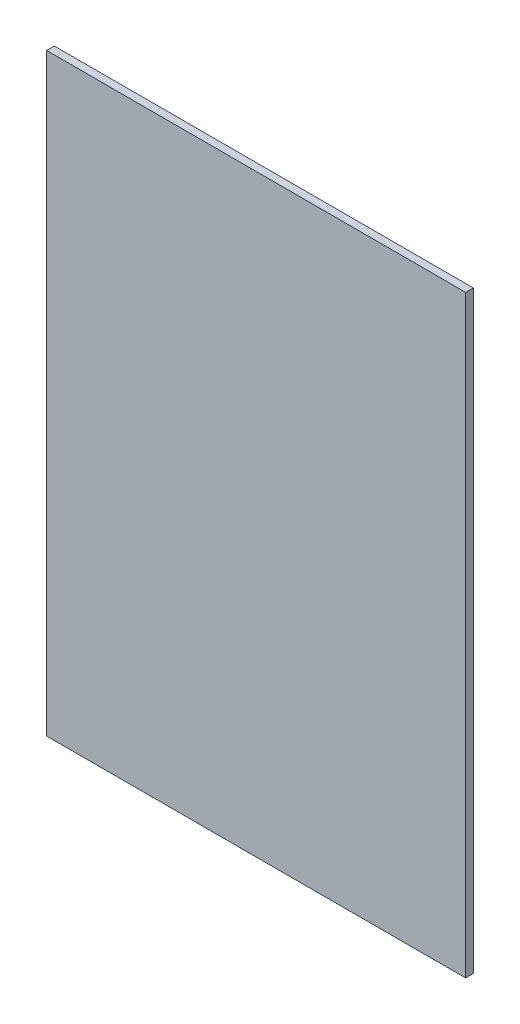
ISO-10303-21;
HEADER;
FILE_DESCRIPTION(('STEP AP214'),'2;1');
FILE_NAME('part.step','',(''),(''),'','','');
FILE_SCHEMA(('AUTOMOTIVE_DESIGN { 1 0 10303 214 1 1 1 1 }'));
ENDSEC;
DATA;
#1=APPLICATION_CONTEXT('core data for automotive mechanical design processes');
#2=APPLICATION_PROTOCOL_DEFINITION('international standard','automotive_design',2000,#1);
#3=PRODUCT_CONTEXT('',#1,'mechanical');
#4=PRODUCT('Part','Part','',(#3));
#5=PRODUCT_RELATED_PRODUCT_CATEGORY('part','',(#4));
#6=PRODUCT_DEFINITION_FORMATION('','',#4);
#7=PRODUCT_DEFINITION_CONTEXT('part definition',#1,'design');
#8=PRODUCT_DEFINITION('design','',#6,#7);
#9=PRODUCT_DEFINITION_SHAPE('','',#8);
#10=(LENGTH_UNIT() NAMED_UNIT(*) SI_UNIT(.MILLI.,.METRE.));
#11=(NAMED_UNIT(*) PLANE_ANGLE_UNIT() SI_UNIT($,.RADIAN.));
#12=(NAMED_UNIT(*) SI_UNIT($,.STERADIAN.) SOLID_ANGLE_UNIT());
#13=UNCERTAINTY_MEASURE_WITH_UNIT(LENGTH_MEASURE(1.E-05),#10,'distance_accuracy_value','');
#14=(GEOMETRIC_REPRESENTATION_CONTEXT(3) GLOBAL_UNCERTAINTY_ASSIGNED_CONTEXT((#13)) GLOBAL_UNIT_ASSIGNED_CONTEXT((#10,
#11,#12)) REPRESENTATION_CONTEXT('',''));
#15=CARTESIAN_POINT('',(0.,0.,0.));
#16=DIRECTION('',(0.,0.,1.));
#17=DIRECTION('',(1.,0.,0.));
#18=AXIS2_PLACEMENT_3D('',#15,#16,#17);
#19=CARTESIAN_POINT('',(76.2,107.95,2.794));
#20=DIRECTION('',(-1.,0.,0.));
#21=DIRECTION('',(0.,-1.,0.));
#22=AXIS2_PLACEMENT_3D('',#19,#20,#21);
#23=PLANE('',#22);
#24=DIRECTION('',(0.,1.,0.));
#25=VECTOR('',#24,1.);
#26=CARTESIAN_POINT('',(76.2,107.95,0.));
#27=LINE('',#26,#25);
#28=CARTESIAN_POINT('',(76.2,-107.95,0.));
#29=VERTEX_POINT('',#28);
#30=CARTESIAN_POINT('',(76.2,107.95,0.));
#31=VERTEX_POINT('',#30);
#32=EDGE_CURVE('E96',#29,#31,#27,.T.);
#33=ORIENTED_EDGE('',*,*,#32,.T.);
#34=DIRECTION('',(0.,0.,-1.));
#35=VECTOR('',#34,1.);
#36=CARTESIAN_POINT('',(76.2,107.95,2.794));
#37=LINE('',#36,#35);
#38=CARTESIAN_POINT('',(76.2,107.95,2.794));
#39=VERTEX_POINT('',#38);
#40=EDGE_CURVE('E11',#39,#31,#37,.T.);
#41=ORIENTED_EDGE('',*,*,#40,.F.);
#42=DIRECTION('',(0.,1.,0.));
#43=VECTOR('',#42,1.);
#44=CARTESIAN_POINT('',(76.2,107.95,2.794));
#45=LINE('',#44,#43);
#46=CARTESIAN_POINT('',(76.2,-107.95,2.794));
#47=VERTEX_POINT('',#46);
#48=EDGE_CURVE('E84',#47,#39,#45,.T.);
#49=ORIENTED_EDGE('',*,*,#48,.F.);
#50=DIRECTION('',(0.,0.,-1.));
#51=VECTOR('',#50,1.);
#52=CARTESIAN_POINT('',(76.2,-107.95,2.794));
#53=LINE('',#52,#51);
#54=EDGE_CURVE('E92',#47,#29,#53,.T.);
#55=ORIENTED_EDGE('',*,*,#54,.T.);
#56=EDGE_LOOP('',(#33,#41,#49,#55));
#57=FACE_BOUND('',#56,.T.);
#58=ADVANCED_FACE('F33',(#57),#23,.F.);
#59=CARTESIAN_POINT('',(-76.2,107.95,2.794));
#60=DIRECTION('',(0.,-1.,0.));
#61=DIRECTION('',(0.,0.,-1.));
#62=AXIS2_PLACEMENT_3D('',#59,#60,#61);
#63=PLANE('',#62);
#64=DIRECTION('',(-1.,0.,0.));
#65=VECTOR('',#64,1.);
#66=CARTESIAN_POINT('',(-76.2,107.95,0.));
#67=LINE('',#66,#65);
#68=CARTESIAN_POINT('',(-76.2,107.95,0.));
#69=VERTEX_POINT('',#68);
#70=EDGE_CURVE('E88',#31,#69,#67,.T.);
#71=ORIENTED_EDGE('',*,*,#70,.T.);
#72=DIRECTION('',(0.,0.,-1.));
#73=VECTOR('',#72,1.);
#74=CARTESIAN_POINT('',(-76.2,107.95,2.794));
#75=LINE('',#74,#73);
#76=CARTESIAN_POINT('',(-76.2,107.95,2.794));
#77=VERTEX_POINT('',#76);
#78=EDGE_CURVE('E41',#77,#69,#75,.T.);
#79=ORIENTED_EDGE('',*,*,#78,.F.);
#80=DIRECTION('',(-1.,0.,0.));
#81=VECTOR('',#80,1.);
#82=CARTESIAN_POINT('',(-76.2,107.95,2.794));
#83=LINE('',#82,#81);
#84=EDGE_CURVE('E79',#39,#77,#83,.T.);
#85=ORIENTED_EDGE('',*,*,#84,.F.);
#86=ORIENTED_EDGE('',*,*,#40,.T.);
#87=EDGE_LOOP('',(#71,#79,#85,#86));
#88=FACE_BOUND('',#87,.T.);
#89=ADVANCED_FACE('F87',(#88),#63,.F.);
#90=CARTESIAN_POINT('',(-76.2,107.95,2.794));
#91=DIRECTION('',(1.,0.,0.));
#92=DIRECTION('',(0.,1.,0.));
#93=AXIS2_PLACEMENT_3D('',#90,#91,#92);
#94=PLANE('',#93);
#95=DIRECTION('',(0.,-1.,0.));
#96=VECTOR('',#95,1.);
#97=CARTESIAN_POINT('',(-76.2,107.95,0.));
#98=LINE('',#97,#96);
#99=CARTESIAN_POINT('',(-76.2,-107.95,0.));
#100=VERTEX_POINT('',#99);
#101=EDGE_CURVE('E66',#69,#100,#98,.T.);
#102=ORIENTED_EDGE('',*,*,#101,.T.);
#103=DIRECTION('',(0.,0.,-1.));
#104=VECTOR('',#103,1.);
#105=CARTESIAN_POINT('',(-76.2,-107.95,2.794));
#106=LINE('',#105,#104);
#107=CARTESIAN_POINT('',(-76.2,-107.95,2.794));
#108=VERTEX_POINT('',#107);
#109=EDGE_CURVE('E89',#108,#100,#106,.T.);
#110=ORIENTED_EDGE('',*,*,#109,.F.);
#111=DIRECTION('',(0.,-1.,0.));
#112=VECTOR('',#111,1.);
#113=CARTESIAN_POINT('',(-76.2,107.95,2.794));
#114=LINE('',#113,#112);
#115=EDGE_CURVE('E82',#77,#108,#114,.T.);
#116=ORIENTED_EDGE('',*,*,#115,.F.);
#117=ORIENTED_EDGE('',*,*,#78,.T.);
#118=EDGE_LOOP('',(#102,#110,#116,#117));
#119=FACE_BOUND('',#118,.T.);
#120=ADVANCED_FACE('F90',(#119),#94,.F.);
#121=CARTESIAN_POINT('',(-76.2,-107.95,2.794));
#122=DIRECTION('',(0.,1.,0.));
#123=DIRECTION('',(0.,0.,1.));
#124=AXIS2_PLACEMENT_3D('',#121,#122,#123);
#125=PLANE('',#124);
#126=DIRECTION('',(1.,0.,0.));
#127=VECTOR('',#126,1.);
#128=CARTESIAN_POINT('',(-76.2,-107.95,0.));
#129=LINE('',#128,#127);
#130=EDGE_CURVE('E72',#100,#29,#129,.T.);
#131=ORIENTED_EDGE('',*,*,#130,.T.);
#132=ORIENTED_EDGE('',*,*,#54,.F.);
#133=DIRECTION('',(1.,0.,0.));
#134=VECTOR('',#133,1.);
#135=CARTESIAN_POINT('',(-76.2,-107.95,2.794));
#136=LINE('',#135,#134);
#137=EDGE_CURVE('E49',#108,#47,#136,.T.);
#138=ORIENTED_EDGE('',*,*,#137,.F.);
#139=ORIENTED_EDGE('',*,*,#109,.T.);
#140=EDGE_LOOP('',(#131,#132,#138,#139));
#141=FACE_BOUND('',#140,.T.);
#142=ADVANCED_FACE('F103',(#141),#125,.F.);
#143=CARTESIAN_POINT('',(0.,0.,2.794));
#144=DIRECTION('',(0.,0.,1.));
#145=DIRECTION('',(1.,0.,0.));
#146=AXIS2_PLACEMENT_3D('',#143,#144,#145);
#147=PLANE('',#146);
#148=ORIENTED_EDGE('',*,*,#48,.T.);
#149=ORIENTED_EDGE('',*,*,#84,.T.);
#150=ORIENTED_EDGE('',*,*,#115,.T.);
#151=ORIENTED_EDGE('',*,*,#137,.T.);
#152=EDGE_LOOP('',(#148,#149,#150,#151));
#153=FACE_BOUND('',#152,.T.);
#154=ADVANCED_FACE('F80',(#153),#147,.T.);
#155=CARTESIAN_POINT('',(0.,0.,0.));
#156=DIRECTION('',(0.,0.,1.));
#157=DIRECTION('',(1.,0.,0.));
#158=AXIS2_PLACEMENT_3D('',#155,#156,#157);
#159=PLANE('',#158);
#160=ORIENTED_EDGE('',*,*,#32,.F.);
#161=ORIENTED_EDGE('',*,*,#130,.F.);
#162=ORIENTED_EDGE('',*,*,#101,.F.);
#163=ORIENTED_EDGE('',*,*,#70,.F.);
#164=EDGE_LOOP('',(#160,#161,#162,#163));
#165=FACE_BOUND('',#164,.T.);
#166=ADVANCED_FACE('F106',(#165),#159,.F.);
#167=CLOSED_SHELL('',(#58,#89,#120,#142,#154,#166));
#168=MANIFOLD_SOLID_BREP('B2',#167);
#169=ADVANCED_BREP_SHAPE_REPRESENTATION('',(#18,#168),#14);
#170=SHAPE_DEFINITION_REPRESENTATION(#9,#169);
ENDSEC;
END-ISO-10303-21;
